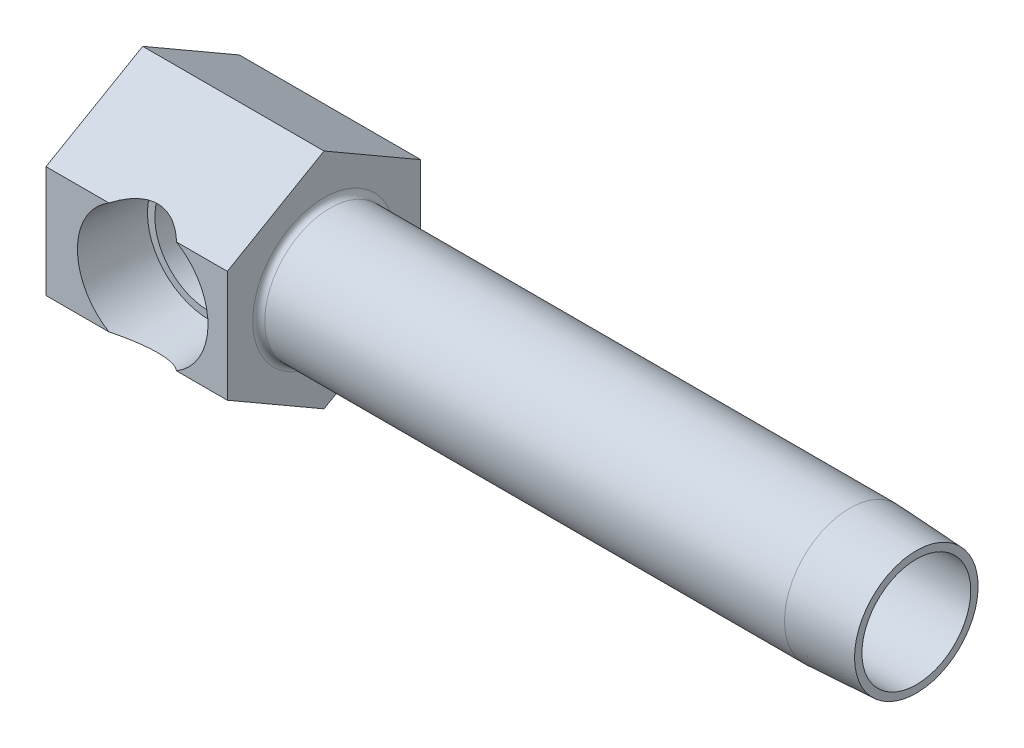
ISO-10303-21;
HEADER;
FILE_DESCRIPTION(('STEP AP214'),'2;1');
FILE_NAME('part.step','',(''),(''),'','','');
FILE_SCHEMA(('AUTOMOTIVE_DESIGN { 1 0 10303 214 1 1 1 1 }'));
ENDSEC;
DATA;
#1=APPLICATION_CONTEXT('core data for automotive mechanical design processes');
#2=APPLICATION_PROTOCOL_DEFINITION('international standard','automotive_design',2000,#1);
#3=PRODUCT_CONTEXT('',#1,'mechanical');
#4=PRODUCT('Part','Part','',(#3));
#5=PRODUCT_RELATED_PRODUCT_CATEGORY('part','',(#4));
#6=PRODUCT_DEFINITION_FORMATION('','',#4);
#7=PRODUCT_DEFINITION_CONTEXT('part definition',#1,'design');
#8=PRODUCT_DEFINITION('design','',#6,#7);
#9=PRODUCT_DEFINITION_SHAPE('','',#8);
#10=(LENGTH_UNIT() NAMED_UNIT(*) SI_UNIT(.MILLI.,.METRE.));
#11=(NAMED_UNIT(*) PLANE_ANGLE_UNIT() SI_UNIT($,.RADIAN.));
#12=(NAMED_UNIT(*) SI_UNIT($,.STERADIAN.) SOLID_ANGLE_UNIT());
#13=UNCERTAINTY_MEASURE_WITH_UNIT(LENGTH_MEASURE(1.E-05),#10,'distance_accuracy_value','');
#14=(GEOMETRIC_REPRESENTATION_CONTEXT(3) GLOBAL_UNCERTAINTY_ASSIGNED_CONTEXT((#13)) GLOBAL_UNIT_ASSIGNED_CONTEXT((#10,
#11,#12)) REPRESENTATION_CONTEXT('',''));
#15=CARTESIAN_POINT('',(0.,0.,0.));
#16=DIRECTION('',(0.,0.,1.));
#17=DIRECTION('',(1.,0.,0.));
#18=AXIS2_PLACEMENT_3D('',#15,#16,#17);
#19=CARTESIAN_POINT('',(63.5,0.,12.7));
#20=DIRECTION('',(-1.,0.,0.));
#21=DIRECTION('',(0.,-1.,0.));
#22=AXIS2_PLACEMENT_3D('',#19,#20,#21);
#23=CYLINDRICAL_SURFACE('',#22,8.5725);
#24=CARTESIAN_POINT('',(24.5999,0.,12.7));
#25=DIRECTION('',(-1.,0.,0.));
#26=DIRECTION('',(0.,-1.,0.));
#27=AXIS2_PLACEMENT_3D('',#24,#25,#26);
#28=CIRCLE('',#27,8.5725);
#29=CARTESIAN_POINT('',(24.5999,-8.57249999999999,12.7));
#30=VERTEX_POINT('',#29);
#31=EDGE_CURVE('E22',#30,#30,#28,.F.);
#32=ORIENTED_EDGE('',*,*,#31,.T.);
#33=EDGE_LOOP('',(#32));
#34=FACE_BOUND('',#33,.T.);
#35=CARTESIAN_POINT('',(92.8624,0.,12.7));
#36=DIRECTION('',(-1.,0.,0.));
#37=DIRECTION('',(0.,0.,1.));
#38=AXIS2_PLACEMENT_3D('',#35,#36,#37);
#39=CIRCLE('',#38,8.5725);
#40=CARTESIAN_POINT('',(92.8624,0.,21.2725));
#41=VERTEX_POINT('',#40);
#42=EDGE_CURVE('E153',#41,#41,#39,.T.);
#43=ORIENTED_EDGE('',*,*,#42,.T.);
#44=EDGE_LOOP('',(#43));
#45=FACE_BOUND('',#44,.T.);
#46=ADVANCED_FACE('F15',(#34,#45),#23,.T.);
#47=CARTESIAN_POINT('',(23.8125,14.6646968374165,12.7));
#48=DIRECTION('',(0.,-0.866025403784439,-0.5));
#49=DIRECTION('',(0.,0.5,-0.866025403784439));
#50=AXIS2_PLACEMENT_3D('',#47,#48,#49);
#51=PLANE('',#50);
#52=CARTESIAN_POINT('',(12.7,-0.84553451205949,39.56450873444));
#53=DIRECTION('',(0.,-0.866025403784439,-0.5));
#54=DIRECTION('',(0.,-0.5,0.866025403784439));
#55=AXIS2_PLACEMENT_3D('',#52,#53,#54);
#56=ELLIPSE('',#55,18.6296608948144,9.27637524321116);
#57=CARTESIAN_POINT('',(17.1412186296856,7.33234841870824,25.4));
#58=VERTEX_POINT('',#57);
#59=CARTESIAN_POINT('',(8.25878137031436,7.33234841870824,25.4));
#60=VERTEX_POINT('',#59);
#61=EDGE_CURVE('E232',#58,#60,#56,.F.);
#62=ORIENTED_EDGE('',*,*,#61,.F.);
#63=DIRECTION('',(-1.,0.,0.));
#64=VECTOR('',#63,1.);
#65=CARTESIAN_POINT('',(23.8125,7.33234841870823,25.4));
#66=LINE('',#65,#64);
#67=CARTESIAN_POINT('',(23.8125,7.33234841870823,25.4));
#68=VERTEX_POINT('',#67);
#69=EDGE_CURVE('E202',#68,#58,#66,.T.);
#70=ORIENTED_EDGE('',*,*,#69,.F.);
#71=DIRECTION('',(0.,-0.5,0.866025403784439));
#72=VECTOR('',#71,1.);
#73=CARTESIAN_POINT('',(23.8125,14.6646968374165,12.7));
#74=LINE('',#73,#72);
#75=CARTESIAN_POINT('',(23.8125,14.6646968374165,12.7));
#76=VERTEX_POINT('',#75);
#77=EDGE_CURVE('E222',#76,#68,#74,.T.);
#78=ORIENTED_EDGE('',*,*,#77,.F.);
#79=DIRECTION('',(-1.,0.,0.));
#80=VECTOR('',#79,1.);
#81=CARTESIAN_POINT('',(23.8125,14.6646968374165,12.7));
#82=LINE('',#81,#80);
#83=CARTESIAN_POINT('',(0.,14.6646968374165,12.7));
#84=VERTEX_POINT('',#83);
#85=EDGE_CURVE('E199',#76,#84,#82,.T.);
#86=ORIENTED_EDGE('',*,*,#85,.T.);
#87=DIRECTION('',(0.,-0.5,0.866025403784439));
#88=VECTOR('',#87,1.);
#89=CARTESIAN_POINT('',(0.,14.6646968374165,12.7));
#90=LINE('',#89,#88);
#91=CARTESIAN_POINT('',(0.,7.33234841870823,25.4));
#92=VERTEX_POINT('',#91);
#93=EDGE_CURVE('E239',#84,#92,#90,.T.);
#94=ORIENTED_EDGE('',*,*,#93,.T.);
#95=EDGE_CURVE('E205',#60,#92,#66,.T.);
#96=ORIENTED_EDGE('',*,*,#95,.F.);
#97=EDGE_LOOP('',(#62,#70,#78,#86,#94,#96));
#98=FACE_BOUND('',#97,.T.);
#99=ADVANCED_FACE('F174',(#98),#51,.F.);
#100=CARTESIAN_POINT('',(23.8125,7.33234841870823,25.4));
#101=DIRECTION('',(0.,0.,-1.));
#102=DIRECTION('',(-1.,0.,0.));
#103=AXIS2_PLACEMENT_3D('',#100,#101,#102);
#104=PLANE('',#103);
#105=CARTESIAN_POINT('',(12.7,0.,25.4));
#106=DIRECTION('',(0.,0.,-1.));
#107=DIRECTION('',(-1.,0.,0.));
#108=AXIS2_PLACEMENT_3D('',#105,#106,#107);
#109=CIRCLE('',#108,8.5725);
#110=CARTESIAN_POINT('',(17.1412186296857,-7.33234841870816,25.4));
#111=VERTEX_POINT('',#110);
#112=EDGE_CURVE('E249',#58,#111,#109,.T.);
#113=ORIENTED_EDGE('',*,*,#112,.T.);
#114=DIRECTION('',(-1.,0.,0.));
#115=VECTOR('',#114,1.);
#116=CARTESIAN_POINT('',(23.8125,-7.33234841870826,25.4));
#117=LINE('',#116,#115);
#118=CARTESIAN_POINT('',(23.8125,-7.33234841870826,25.4));
#119=VERTEX_POINT('',#118);
#120=EDGE_CURVE('E206',#119,#111,#117,.T.);
#121=ORIENTED_EDGE('',*,*,#120,.F.);
#122=DIRECTION('',(0.,-1.,0.));
#123=VECTOR('',#122,1.);
#124=CARTESIAN_POINT('',(23.8125,7.33234841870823,25.4));
#125=LINE('',#124,#123);
#126=EDGE_CURVE('E220',#68,#119,#125,.T.);
#127=ORIENTED_EDGE('',*,*,#126,.F.);
#128=ORIENTED_EDGE('',*,*,#69,.T.);
#129=EDGE_LOOP('',(#113,#121,#127,#128));
#130=FACE_BOUND('',#129,.T.);
#131=ADVANCED_FACE('F180',(#130),#104,.F.);
#132=CARTESIAN_POINT('',(8.25878137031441,-7.33234841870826,25.4));
#133=VERTEX_POINT('',#132);
#134=EDGE_CURVE('E36',#133,#60,#109,.T.);
#135=ORIENTED_EDGE('',*,*,#134,.T.);
#136=ORIENTED_EDGE('',*,*,#95,.T.);
#137=DIRECTION('',(0.,-1.,0.));
#138=VECTOR('',#137,1.);
#139=CARTESIAN_POINT('',(0.,7.33234841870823,25.4));
#140=LINE('',#139,#138);
#141=CARTESIAN_POINT('',(0.,-7.33234841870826,25.4));
#142=VERTEX_POINT('',#141);
#143=EDGE_CURVE('E235',#92,#142,#140,.T.);
#144=ORIENTED_EDGE('',*,*,#143,.T.);
#145=EDGE_CURVE('E209',#133,#142,#117,.T.);
#146=ORIENTED_EDGE('',*,*,#145,.F.);
#147=EDGE_LOOP('',(#135,#136,#144,#146));
#148=FACE_BOUND('',#147,.T.);
#149=ADVANCED_FACE('F285',(#148),#104,.F.);
#150=CARTESIAN_POINT('',(23.8125,-7.33234841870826,25.4));
#151=DIRECTION('',(0.,0.86602540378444,-0.5));
#152=DIRECTION('',(0.,0.5,0.86602540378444));
#153=AXIS2_PLACEMENT_3D('',#150,#151,#152);
#154=PLANE('',#153);
#155=CARTESIAN_POINT('',(12.7,0.845534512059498,39.5645087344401));
#156=DIRECTION('',(0.,0.86602540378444,-0.5));
#157=DIRECTION('',(0.,0.5,0.86602540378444));
#158=AXIS2_PLACEMENT_3D('',#155,#156,#157);
#159=ELLIPSE('',#158,18.6296608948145,9.27637524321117);
#160=EDGE_CURVE('E10',#133,#111,#159,.F.);
#161=ORIENTED_EDGE('',*,*,#160,.F.);
#162=ORIENTED_EDGE('',*,*,#145,.T.);
#163=DIRECTION('',(0.,-0.5,-0.86602540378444));
#164=VECTOR('',#163,1.);
#165=CARTESIAN_POINT('',(0.,-7.33234841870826,25.4));
#166=LINE('',#165,#164);
#167=CARTESIAN_POINT('',(0.,-14.6646968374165,12.7));
#168=VERTEX_POINT('',#167);
#169=EDGE_CURVE('E218',#142,#168,#166,.T.);
#170=ORIENTED_EDGE('',*,*,#169,.T.);
#171=DIRECTION('',(-1.,0.,0.));
#172=VECTOR('',#171,1.);
#173=CARTESIAN_POINT('',(23.8125,-14.6646968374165,12.7));
#174=LINE('',#173,#172);
#175=CARTESIAN_POINT('',(23.8125,-14.6646968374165,12.7));
#176=VERTEX_POINT('',#175);
#177=EDGE_CURVE('E210',#176,#168,#174,.T.);
#178=ORIENTED_EDGE('',*,*,#177,.F.);
#179=DIRECTION('',(0.,-0.5,-0.86602540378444));
#180=VECTOR('',#179,1.);
#181=CARTESIAN_POINT('',(23.8125,-7.33234841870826,25.4));
#182=LINE('',#181,#180);
#183=EDGE_CURVE('E213',#119,#176,#182,.T.);
#184=ORIENTED_EDGE('',*,*,#183,.F.);
#185=ORIENTED_EDGE('',*,*,#120,.T.);
#186=EDGE_LOOP('',(#161,#162,#170,#178,#184,#185));
#187=FACE_BOUND('',#186,.T.);
#188=ADVANCED_FACE('F281',(#187),#154,.F.);
#189=CARTESIAN_POINT('',(23.8125,-14.6646968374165,12.7));
#190=DIRECTION('',(0.,0.866025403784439,0.5));
#191=DIRECTION('',(0.,-0.5,0.866025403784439));
#192=AXIS2_PLACEMENT_3D('',#189,#190,#191);
#193=PLANE('',#192);
#194=DIRECTION('',(0.,0.5,-0.866025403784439));
#195=VECTOR('',#194,1.);
#196=CARTESIAN_POINT('',(0.,-14.6646968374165,12.7));
#197=LINE('',#196,#195);
#198=CARTESIAN_POINT('',(0.,-7.33234841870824,0.));
#199=VERTEX_POINT('',#198);
#200=EDGE_CURVE('E227',#168,#199,#197,.T.);
#201=ORIENTED_EDGE('',*,*,#200,.T.);
#202=DIRECTION('',(-1.,0.,0.));
#203=VECTOR('',#202,1.);
#204=CARTESIAN_POINT('',(23.8125,-7.33234841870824,0.));
#205=LINE('',#204,#203);
#206=CARTESIAN_POINT('',(23.8125,-7.33234841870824,0.));
#207=VERTEX_POINT('',#206);
#208=EDGE_CURVE('E191',#207,#199,#205,.T.);
#209=ORIENTED_EDGE('',*,*,#208,.F.);
#210=DIRECTION('',(0.,0.5,-0.866025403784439));
#211=VECTOR('',#210,1.);
#212=CARTESIAN_POINT('',(23.8125,-14.6646968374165,12.7));
#213=LINE('',#212,#211);
#214=EDGE_CURVE('E214',#176,#207,#213,.T.);
#215=ORIENTED_EDGE('',*,*,#214,.F.);
#216=ORIENTED_EDGE('',*,*,#177,.T.);
#217=EDGE_LOOP('',(#201,#209,#215,#216));
#218=FACE_BOUND('',#217,.T.);
#219=ADVANCED_FACE('F284',(#218),#193,.F.);
#220=CARTESIAN_POINT('',(23.8125,-7.33234841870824,0.));
#221=DIRECTION('',(0.,0.,1.));
#222=DIRECTION('',(0.,-1.,0.));
#223=AXIS2_PLACEMENT_3D('',#220,#221,#222);
#224=PLANE('',#223);
#225=DIRECTION('',(0.,1.,0.));
#226=VECTOR('',#225,1.);
#227=CARTESIAN_POINT('',(0.,-7.33234841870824,0.));
#228=LINE('',#227,#226);
#229=CARTESIAN_POINT('',(0.,7.33234841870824,0.));
#230=VERTEX_POINT('',#229);
#231=EDGE_CURVE('E231',#199,#230,#228,.T.);
#232=ORIENTED_EDGE('',*,*,#231,.T.);
#233=DIRECTION('',(-1.,0.,0.));
#234=VECTOR('',#233,1.);
#235=CARTESIAN_POINT('',(23.8125,7.33234841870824,0.));
#236=LINE('',#235,#234);
#237=CARTESIAN_POINT('',(23.8125,7.33234841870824,0.));
#238=VERTEX_POINT('',#237);
#239=EDGE_CURVE('E196',#238,#230,#236,.T.);
#240=ORIENTED_EDGE('',*,*,#239,.F.);
#241=DIRECTION('',(0.,1.,0.));
#242=VECTOR('',#241,1.);
#243=CARTESIAN_POINT('',(23.8125,-7.33234841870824,0.));
#244=LINE('',#243,#242);
#245=EDGE_CURVE('E217',#207,#238,#244,.T.);
#246=ORIENTED_EDGE('',*,*,#245,.F.);
#247=ORIENTED_EDGE('',*,*,#208,.T.);
#248=EDGE_LOOP('',(#232,#240,#246,#247));
#249=FACE_BOUND('',#248,.T.);
#250=ADVANCED_FACE('F292',(#249),#224,.F.);
#251=CARTESIAN_POINT('',(23.8125,7.33234841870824,0.));
#252=DIRECTION('',(0.,-0.866025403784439,0.5));
#253=DIRECTION('',(0.,-0.5,-0.866025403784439));
#254=AXIS2_PLACEMENT_3D('',#251,#252,#253);
#255=PLANE('',#254);
#256=DIRECTION('',(0.,0.5,0.866025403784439));
#257=VECTOR('',#256,1.);
#258=CARTESIAN_POINT('',(0.,7.33234841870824,0.));
#259=LINE('',#258,#257);
#260=EDGE_CURVE('E243',#230,#84,#259,.T.);
#261=ORIENTED_EDGE('',*,*,#260,.T.);
#262=ORIENTED_EDGE('',*,*,#85,.F.);
#263=DIRECTION('',(0.,0.5,0.866025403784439));
#264=VECTOR('',#263,1.);
#265=CARTESIAN_POINT('',(23.8125,7.33234841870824,0.));
#266=LINE('',#265,#264);
#267=EDGE_CURVE('E224',#238,#76,#266,.T.);
#268=ORIENTED_EDGE('',*,*,#267,.F.);
#269=ORIENTED_EDGE('',*,*,#239,.T.);
#270=EDGE_LOOP('',(#261,#262,#268,#269));
#271=FACE_BOUND('',#270,.T.);
#272=ADVANCED_FACE('F279',(#271),#255,.F.);
#273=CARTESIAN_POINT('',(23.8125,-21.9970452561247,25.4));
#274=DIRECTION('',(-1.,0.,0.));
#275=DIRECTION('',(0.,-1.,0.));
#276=AXIS2_PLACEMENT_3D('',#273,#274,#275);
#277=PLANE('',#276);
#278=CARTESIAN_POINT('',(23.8125,0.,12.7));
#279=DIRECTION('',(-1.,0.,0.));
#280=DIRECTION('',(0.,-1.,0.));
#281=AXIS2_PLACEMENT_3D('',#278,#279,#280);
#282=CIRCLE('',#281,9.3599);
#283=CARTESIAN_POINT('',(23.8125,-9.35989999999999,12.7));
#284=VERTEX_POINT('',#283);
#285=EDGE_CURVE('E189',#284,#284,#282,.T.);
#286=ORIENTED_EDGE('',*,*,#285,.T.);
#287=EDGE_LOOP('',(#286));
#288=FACE_BOUND('',#287,.T.);
#289=ORIENTED_EDGE('',*,*,#214,.T.);
#290=ORIENTED_EDGE('',*,*,#245,.T.);
#291=ORIENTED_EDGE('',*,*,#267,.T.);
#292=ORIENTED_EDGE('',*,*,#77,.T.);
#293=ORIENTED_EDGE('',*,*,#126,.T.);
#294=ORIENTED_EDGE('',*,*,#183,.T.);
#295=EDGE_LOOP('',(#289,#290,#291,#292,#293,#294));
#296=FACE_BOUND('',#295,.T.);
#297=ADVANCED_FACE('F275',(#288,#296),#277,.F.);
#298=CARTESIAN_POINT('',(0.,-21.9970452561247,25.4));
#299=DIRECTION('',(-1.,0.,0.));
#300=DIRECTION('',(0.,-1.,0.));
#301=AXIS2_PLACEMENT_3D('',#298,#299,#300);
#302=PLANE('',#301);
#303=ORIENTED_EDGE('',*,*,#200,.F.);
#304=ORIENTED_EDGE('',*,*,#169,.F.);
#305=ORIENTED_EDGE('',*,*,#143,.F.);
#306=ORIENTED_EDGE('',*,*,#93,.F.);
#307=ORIENTED_EDGE('',*,*,#260,.F.);
#308=ORIENTED_EDGE('',*,*,#231,.F.);
#309=EDGE_LOOP('',(#303,#304,#305,#306,#307,#308));
#310=FACE_BOUND('',#309,.T.);
#311=ADVANCED_FACE('F272',(#310),#302,.T.);
#312=CARTESIAN_POINT('',(24.5999,0.,12.7));
#313=DIRECTION('',(-1.,0.,0.));
#314=DIRECTION('',(0.,-1.,0.));
#315=AXIS2_PLACEMENT_3D('',#312,#313,#314);
#316=TOROIDAL_SURFACE('',#315,9.3599,0.7874);
#317=ORIENTED_EDGE('',*,*,#31,.F.);
#318=EDGE_LOOP('',(#317));
#319=FACE_BOUND('',#318,.T.);
#320=ORIENTED_EDGE('',*,*,#285,.F.);
#321=EDGE_LOOP('',(#320));
#322=FACE_BOUND('',#321,.T.);
#323=ADVANCED_FACE('F269',(#319,#322),#316,.F.);
#324=CARTESIAN_POINT('',(12.7,0.,25.4));
#325=DIRECTION('',(0.,0.,1.));
#326=DIRECTION('',(1.,0.,0.));
#327=AXIS2_PLACEMENT_3D('',#324,#325,#326);
#328=CONICAL_SURFACE('',#327,8.5725,0.0523598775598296);
#329=CARTESIAN_POINT('',(18.2237788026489,-5.94425228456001,16.6622));
#330=CARTESIAN_POINT('',(18.2916176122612,-5.88732299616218,16.7476009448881));
#331=CARTESIAN_POINT('',(18.3592795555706,-5.82850059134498,16.8318676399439));
#332=CARTESIAN_POINT('',(18.4939968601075,-5.70702027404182,16.9981035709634));
#333=CARTESIAN_POINT('',(18.5610521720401,-5.64436205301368,17.0800726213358));
#334=CARTESIAN_POINT('',(18.761107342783,-5.45038497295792,17.3227058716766));
#335=CARTESIAN_POINT('',(18.8927964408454,-5.31322998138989,17.479846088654));
#336=CARTESIAN_POINT('',(19.1518580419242,-5.0216447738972,17.785397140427));
#337=CARTESIAN_POINT('',(19.2791735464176,-4.8670541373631,17.933703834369));
#338=CARTESIAN_POINT('',(19.5257752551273,-4.5416930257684,18.2184184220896));
#339=CARTESIAN_POINT('',(19.6450670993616,-4.37093412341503,18.35483469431));
#340=CARTESIAN_POINT('',(19.9295445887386,-3.92497659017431,18.6779693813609));
#341=CARTESIAN_POINT('',(20.0885588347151,-3.63961711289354,18.8565618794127));
#342=CARTESIAN_POINT('',(20.3031266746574,-3.18637161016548,19.0960411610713));
#343=CARTESIAN_POINT('',(20.3705741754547,-3.03133869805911,19.1710418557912));
#344=CARTESIAN_POINT('',(20.4965477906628,-2.71316594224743,19.3107517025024));
#345=CARTESIAN_POINT('',(20.5550753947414,-2.55002745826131,19.3754625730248));
#346=CARTESIAN_POINT('',(20.6538405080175,-2.24208944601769,19.4844409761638));
#347=CARTESIAN_POINT('',(20.6955064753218,-2.09831594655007,19.5303217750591));
#348=CARTESIAN_POINT('',(20.7709604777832,-1.80624508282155,19.6132970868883));
#349=CARTESIAN_POINT('',(20.8047499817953,-1.65794856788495,19.6503932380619));
#350=CARTESIAN_POINT('',(20.8638747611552,-1.35762804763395,19.7152415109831));
#351=CARTESIAN_POINT('',(20.8892082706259,-1.20560327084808,19.7429916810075));
#352=CARTESIAN_POINT('',(20.9309344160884,-0.898862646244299,19.7886706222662));
#353=CARTESIAN_POINT('',(20.9473269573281,-0.744146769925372,19.8065992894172));
#354=CARTESIAN_POINT('',(20.9708773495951,-0.43270553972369,19.8323499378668));
#355=CARTESIAN_POINT('',(20.9780075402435,-0.275975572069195,19.8401416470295));
#356=CARTESIAN_POINT('',(20.9827943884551,0.0378027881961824,19.8453730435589));
#357=CARTESIAN_POINT('',(20.9804510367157,0.194851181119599,19.8428127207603));
#358=CARTESIAN_POINT('',(20.9663398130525,0.508011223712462,19.8273884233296));
#359=CARTESIAN_POINT('',(20.9545719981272,0.664122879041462,19.8145245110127));
#360=CARTESIAN_POINT('',(20.9218545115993,0.974205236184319,19.77873224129));
#361=CARTESIAN_POINT('',(20.9009049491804,1.12817596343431,19.755804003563));
#362=CARTESIAN_POINT('',(20.8514678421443,1.42545941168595,19.701637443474));
#363=CARTESIAN_POINT('',(20.8233975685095,1.56892578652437,19.670858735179));
#364=CARTESIAN_POINT('',(20.7597875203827,1.85215468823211,19.6010144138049));
#365=CARTESIAN_POINT('',(20.7242449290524,1.99191579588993,19.5619456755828));
#366=CARTESIAN_POINT('',(20.6072066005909,2.40450989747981,19.4330773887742));
#367=CARTESIAN_POINT('',(20.5152596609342,2.67089071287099,19.3315714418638));
#368=CARTESIAN_POINT('',(20.3408066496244,3.10208873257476,19.1379689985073));
#369=CARTESIAN_POINT('',(20.2643220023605,3.27264094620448,19.0528363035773));
#370=CARTESIAN_POINT('',(20.1020422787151,3.60309741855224,18.8714152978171));
#371=CARTESIAN_POINT('',(20.0162439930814,3.76299797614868,18.7751231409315));
#372=CARTESIAN_POINT('',(19.7465644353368,4.22699236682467,18.4708514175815));
#373=CARTESIAN_POINT('',(19.550728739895,4.51459085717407,18.2478400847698));
#374=CARTESIAN_POINT('',(19.2565333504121,4.89305951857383,17.9071622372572));
#375=CARTESIAN_POINT('',(19.1663785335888,5.00247887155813,17.8020703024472));
#376=CARTESIAN_POINT('',(18.9830153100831,5.21324568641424,17.5865045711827));
#377=CARTESIAN_POINT('',(18.8898069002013,5.31459313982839,17.4760307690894));
#378=CARTESIAN_POINT('',(18.7018932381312,5.50848003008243,17.2510129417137));
#379=CARTESIAN_POINT('',(18.6072061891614,5.60108407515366,17.1365090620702));
#380=CARTESIAN_POINT('',(18.4163909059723,5.77848578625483,16.9028222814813));
#381=CARTESIAN_POINT('',(18.320263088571,5.86328566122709,16.783640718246));
#382=CARTESIAN_POINT('',(18.2237788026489,5.94425228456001,16.6622));
#383=B_SPLINE_CURVE_WITH_KNOTS('',3,(#329,#330,#331,#332,#333,#334,#335,#336,#337,#338,#339,
#340,#341,#342,#343,#344,#345,#346,#347,#348,#349,#350,#351,#352,#353,#354,#355,#356,#357,#358,
#359,#360,#361,#362,#363,#364,#365,#366,#367,#368,#369,#370,#371,#372,#373,#374,#375,#376,#377,
#378,#379,#380,#381,#382),.UNSPECIFIED.,.F.,.F.,(4,2,2,2,2,2,2,2,2,2,2,2,2,2,2,2,2,2,2,2,2,2,2,
2,2,2,4),(0.,0.369050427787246,0.738130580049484,1.47737063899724,2.22407355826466,
2.97024599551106,4.0822255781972,4.63656388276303,5.19080950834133,5.66002823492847,
6.12915938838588,6.59838844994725,7.0676224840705,7.53825460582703,8.00888718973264,
8.47951692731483,8.95014106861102,9.3978219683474,9.8456719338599,10.7406458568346,
11.3560801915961,11.9717272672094,13.2057730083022,13.7350494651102,14.2643264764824,
14.7893227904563,15.3141700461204),.UNSPECIFIED.);
#384=CARTESIAN_POINT('',(18.2239376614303,-5.94411896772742,16.6624));
#385=VERTEX_POINT('',#384);
#386=CARTESIAN_POINT('',(18.2239376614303,5.94411896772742,16.6624));
#387=VERTEX_POINT('',#386);
#388=EDGE_CURVE('E128',#385,#387,#383,.T.);
#389=ORIENTED_EDGE('',*,*,#388,.F.);
#390=CARTESIAN_POINT('',(12.7,0.,16.6624));
#391=DIRECTION('',(0.,0.,-1.));
#392=DIRECTION('',(-1.,0.,0.));
#393=AXIS2_PLACEMENT_3D('',#390,#391,#392);
#394=CIRCLE('',#393,8.1145817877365);
#395=EDGE_CURVE('E251',#385,#387,#394,.T.);
#396=ORIENTED_EDGE('',*,*,#395,.T.);
#397=EDGE_LOOP('',(#389,#396));
#398=FACE_BOUND('',#397,.T.);
#399=ORIENTED_EDGE('',*,*,#61,.T.);
#400=ORIENTED_EDGE('',*,*,#134,.F.);
#401=ORIENTED_EDGE('',*,*,#160,.T.);
#402=ORIENTED_EDGE('',*,*,#112,.F.);
#403=EDGE_LOOP('',(#399,#400,#401,#402));
#404=FACE_BOUND('',#403,.T.);
#405=ADVANCED_FACE('F136',(#398,#404),#328,.F.);
#406=CARTESIAN_POINT('',(20.8145817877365,0.,16.6624));
#407=DIRECTION('',(0.,0.,1.));
#408=DIRECTION('',(1.,0.,0.));
#409=AXIS2_PLACEMENT_3D('',#406,#407,#408);
#410=PLANE('',#409);
#411=DIRECTION('',(1.,0.,0.));
#412=VECTOR('',#411,1.);
#413=CARTESIAN_POINT('',(66.667520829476,-5.94411896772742,16.6624));
#414=LINE('',#413,#412);
#415=CARTESIAN_POINT('',(16.6624,-5.9441189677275,16.6624));
#416=VERTEX_POINT('',#415);
#417=EDGE_CURVE('E123',#416,#385,#414,.T.);
#418=ORIENTED_EDGE('',*,*,#417,.F.);
#419=CARTESIAN_POINT('',(12.7,0.,16.6624));
#420=DIRECTION('',(0.,0.,-1.));
#421=DIRECTION('',(-1.,0.,0.));
#422=AXIS2_PLACEMENT_3D('',#419,#420,#421);
#423=CIRCLE('',#422,7.14375);
#424=CARTESIAN_POINT('',(16.6624,5.9441189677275,16.6624));
#425=VERTEX_POINT('',#424);
#426=EDGE_CURVE('E119',#416,#425,#423,.T.);
#427=ORIENTED_EDGE('',*,*,#426,.T.);
#428=DIRECTION('',(1.,0.,0.));
#429=VECTOR('',#428,1.);
#430=CARTESIAN_POINT('',(66.667520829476,5.94411896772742,16.6624));
#431=LINE('',#430,#429);
#432=EDGE_CURVE('E120',#387,#425,#431,.F.);
#433=ORIENTED_EDGE('',*,*,#432,.F.);
#434=ORIENTED_EDGE('',*,*,#395,.F.);
#435=EDGE_LOOP('',(#418,#427,#433,#434));
#436=FACE_BOUND('',#435,.T.);
#437=ADVANCED_FACE('F262',(#436),#410,.T.);
#438=CARTESIAN_POINT('',(12.7,0.,34.595573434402));
#439=DIRECTION('',(0.,0.,-1.));
#440=DIRECTION('',(-1.,0.,0.));
#441=AXIS2_PLACEMENT_3D('',#438,#439,#440);
#442=CYLINDRICAL_SURFACE('',#441,7.14375);
#443=CARTESIAN_POINT('',(12.7,0.,12.7));
#444=DIRECTION('',(0.707106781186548,0.,-0.707106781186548));
#445=DIRECTION('',(-0.707106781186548,0.,-0.707106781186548));
#446=AXIS2_PLACEMENT_3D('',#443,#444,#445);
#447=ELLIPSE('',#446,10.1027881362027,7.14375);
#448=CARTESIAN_POINT('',(12.7,7.14375,12.7));
#449=VERTEX_POINT('',#448);
#450=EDGE_CURVE('E121',#425,#449,#447,.F.);
#451=ORIENTED_EDGE('',*,*,#450,.F.);
#452=ORIENTED_EDGE('',*,*,#426,.F.);
#453=CARTESIAN_POINT('',(12.7,-7.14375,12.7));
#454=VERTEX_POINT('',#453);
#455=EDGE_CURVE('E108',#454,#416,#447,.F.);
#456=ORIENTED_EDGE('',*,*,#455,.F.);
#457=CARTESIAN_POINT('',(12.7,0.,12.7));
#458=DIRECTION('',(-0.707106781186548,0.,-0.707106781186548));
#459=DIRECTION('',(0.707106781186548,0.,-0.707106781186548));
#460=AXIS2_PLACEMENT_3D('',#457,#458,#459);
#461=ELLIPSE('',#460,10.1027881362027,7.14375);
#462=CARTESIAN_POINT('',(18.1005540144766,-4.67623570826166,7.2994459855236));
#463=VERTEX_POINT('',#462);
#464=EDGE_CURVE('E104',#463,#454,#461,.T.);
#465=ORIENTED_EDGE('',*,*,#464,.F.);
#466=CARTESIAN_POINT('',(12.7,0.,7.2994459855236));
#467=DIRECTION('',(0.,0.,-1.));
#468=DIRECTION('',(-1.,0.,0.));
#469=AXIS2_PLACEMENT_3D('',#466,#467,#468);
#470=CIRCLE('',#469,7.14375);
#471=CARTESIAN_POINT('',(18.1005540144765,4.67623570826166,7.2994459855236));
#472=VERTEX_POINT('',#471);
#473=EDGE_CURVE('E134',#463,#472,#470,.T.);
#474=ORIENTED_EDGE('',*,*,#473,.T.);
#475=EDGE_CURVE('E29',#449,#472,#461,.T.);
#476=ORIENTED_EDGE('',*,*,#475,.F.);
#477=EDGE_LOOP('',(#451,#452,#456,#465,#474,#476));
#478=FACE_BOUND('',#477,.T.);
#479=ADVANCED_FACE('F117',(#478),#442,.F.);
#480=CARTESIAN_POINT('',(12.7,0.,7.2994459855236));
#481=DIRECTION('',(0.,0.,1.));
#482=DIRECTION('',(1.,0.,0.));
#483=AXIS2_PLACEMENT_3D('',#480,#481,#482);
#484=CONICAL_SURFACE('',#483,7.14375,1.0471975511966);
#485=CARTESIAN_POINT('',(18.1008122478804,4.67646667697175,7.29964598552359));
#486=CARTESIAN_POINT('',(18.0182484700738,4.60263120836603,7.23572166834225));
#487=CARTESIAN_POINT('',(17.9383238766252,4.52571856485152,7.17175555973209));
#488=CARTESIAN_POINT('',(17.7848563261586,4.36518020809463,7.0441228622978));
#489=CARTESIAN_POINT('',(17.7113260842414,4.28154172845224,6.98045709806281));
#490=CARTESIAN_POINT('',(17.5726476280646,4.1079855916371,6.8545747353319));
#491=CARTESIAN_POINT('',(17.5074361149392,4.01812452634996,6.79235056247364));
#492=CARTESIAN_POINT('',(17.3859720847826,3.83151153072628,6.66964834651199));
#493=CARTESIAN_POINT('',(17.3297132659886,3.73476451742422,6.60916909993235));
#494=CARTESIAN_POINT('',(17.2264163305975,3.53345239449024,6.49019348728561));
#495=CARTESIAN_POINT('',(17.1794940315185,3.42880893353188,6.43172867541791));
#496=CARTESIAN_POINT('',(17.0960237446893,3.21346156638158,6.31865082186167));
#497=CARTESIAN_POINT('',(17.0594774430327,3.10275667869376,6.26403840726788));
#498=CARTESIAN_POINT('',(16.996254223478,2.87633249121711,6.15970832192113));
#499=CARTESIAN_POINT('',(16.9695794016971,2.76061213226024,6.10999169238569));
#500=CARTESIAN_POINT('',(16.9248366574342,2.52527852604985,6.01627423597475));
#501=CARTESIAN_POINT('',(16.9067703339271,2.40566455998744,5.97227447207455));
#502=CARTESIAN_POINT('',(16.872150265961,2.11917129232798,5.87557836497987));
#503=CARTESIAN_POINT('',(16.8585719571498,1.95102064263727,5.82559588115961));
#504=CARTESIAN_POINT('',(16.8395248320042,1.61106163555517,5.73806695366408));
#505=CARTESIAN_POINT('',(16.834060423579,1.43925134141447,5.70052727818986));
#506=CARTESIAN_POINT('',(16.8272216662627,1.09272483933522,5.63811598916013));
#507=CARTESIAN_POINT('',(16.8258602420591,0.918001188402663,5.61328461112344));
#508=CARTESIAN_POINT('',(16.8244844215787,0.567245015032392,5.576623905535));
#509=CARTESIAN_POINT('',(16.8244696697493,0.391212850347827,5.56479114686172));
#510=CARTESIAN_POINT('',(16.8244315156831,0.0298631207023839,5.55391234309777));
#511=CARTESIAN_POINT('',(16.8244077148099,-0.155475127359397,5.55554105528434));
#512=CARTESIAN_POINT('',(16.8245481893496,-0.525517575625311,5.57319743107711));
#513=CARTESIAN_POINT('',(16.8247125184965,-0.710221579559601,5.58922920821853));
#514=CARTESIAN_POINT('',(16.8272365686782,-1.07761401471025,5.63557061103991));
#515=CARTESIAN_POINT('',(16.8295939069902,-1.26030441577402,5.66586472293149));
#516=CARTESIAN_POINT('',(16.8402108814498,-1.62260116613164,5.74051131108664));
#517=CARTESIAN_POINT('',(16.8484676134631,-1.80220898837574,5.78485686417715));
#518=CARTESIAN_POINT('',(16.8713785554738,-2.09762253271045,5.87004472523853));
#519=CARTESIAN_POINT('',(16.8829850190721,-2.21474934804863,5.90713222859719));
#520=CARTESIAN_POINT('',(16.9127302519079,-2.44618190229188,5.98700326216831));
#521=CARTESIAN_POINT('',(16.9308663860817,-2.56048875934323,6.02978449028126));
#522=CARTESIAN_POINT('',(16.9750927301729,-2.78506409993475,6.12039584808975));
#523=CARTESIAN_POINT('',(17.0011553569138,-2.89534512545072,6.16820809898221));
#524=CARTESIAN_POINT('',(17.0623258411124,-3.11130073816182,6.26827147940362));
#525=CARTESIAN_POINT('',(17.0974329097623,-3.21697572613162,6.3205222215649));
#526=CARTESIAN_POINT('',(17.1773511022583,-3.42340093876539,6.42886299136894));
#527=CARTESIAN_POINT('',(17.2222166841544,-3.52411947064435,6.48497330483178));
#528=CARTESIAN_POINT('',(17.3212699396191,-3.71931545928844,6.59977977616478));
#529=CARTESIAN_POINT('',(17.3754591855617,-3.81379185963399,6.65847636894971));
#530=CARTESIAN_POINT('',(17.4924791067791,-3.99641031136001,6.77768652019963));
#531=CARTESIAN_POINT('',(17.5553313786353,-4.08453566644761,6.83820431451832));
#532=CARTESIAN_POINT('',(17.6884734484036,-4.25426378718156,6.96019752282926));
#533=CARTESIAN_POINT('',(17.758764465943,-4.3358654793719,7.02167309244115));
#534=CARTESIAN_POINT('',(17.8750599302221,-4.46018946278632,7.11938400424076));
#535=CARTESIAN_POINT('',(17.9190095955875,-4.5049692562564,7.15548532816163));
#536=CARTESIAN_POINT('',(18.0086324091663,-4.59230195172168,7.22760435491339));
#537=CARTESIAN_POINT('',(18.0542970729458,-4.6348638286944,7.26362172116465));
#538=CARTESIAN_POINT('',(18.1008122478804,-4.67646667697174,7.29964598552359));
#539=B_SPLINE_CURVE_WITH_KNOTS('',3,(#485,#486,#487,#488,#489,#490,#491,#492,#493,#494,#495,
#496,#497,#498,#499,#500,#501,#502,#503,#504,#505,#506,#507,#508,#509,#510,#511,#512,#513,#514,
#515,#516,#517,#518,#519,#520,#521,#522,#523,#524,#525,#526,#527,#528,#529,#530,#531,#532,#533,
#534,#535,#536,#537,#538),.UNSPECIFIED.,.F.,.F.,(4,2,2,2,2,2,2,2,2,2,2,2,2,2,2,2,2,2,2,2,2,2,2,
2,2,2,4),(0.,0.383734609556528,0.768215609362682,1.14957007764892,1.530654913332,
1.91620690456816,2.30182151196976,2.68751795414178,3.07328600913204,3.60029069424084,
4.12758157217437,4.65653172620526,5.18534222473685,5.74081422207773,6.29644491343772,
6.8514726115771,7.40622727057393,7.77616444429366,8.14595249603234,8.5144681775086,
8.8829517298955,9.25354694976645,9.62420472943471,9.99580384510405,10.3674639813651,
10.5845818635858,10.8007392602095),.UNSPECIFIED.);
#540=EDGE_CURVE('E110',#472,#463,#539,.T.);
#541=ORIENTED_EDGE('',*,*,#540,.F.);
#542=ORIENTED_EDGE('',*,*,#473,.F.);
#543=EDGE_LOOP('',(#541,#542));
#544=FACE_BOUND('',#543,.T.);
#545=CARTESIAN_POINT('',(12.7,0.,3.1750000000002));
#546=VERTEX_POINT('',#545);
#547=VERTEX_LOOP('',#546);
#548=FACE_BOUND('',#547,.T.);
#549=ADVANCED_FACE('F144',(#544,#548),#484,.F.);
#550=CARTESIAN_POINT('',(66.667520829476,0.,12.7));
#551=DIRECTION('',(1.,0.,0.));
#552=DIRECTION('',(0.,0.,-1.));
#553=AXIS2_PLACEMENT_3D('',#550,#551,#552);
#554=CYLINDRICAL_SURFACE('',#553,7.1437499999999);
#555=ORIENTED_EDGE('',*,*,#388,.T.);
#556=ORIENTED_EDGE('',*,*,#432,.T.);
#557=ORIENTED_EDGE('',*,*,#450,.T.);
#558=ORIENTED_EDGE('',*,*,#475,.T.);
#559=ORIENTED_EDGE('',*,*,#540,.T.);
#560=ORIENTED_EDGE('',*,*,#464,.T.);
#561=ORIENTED_EDGE('',*,*,#455,.T.);
#562=ORIENTED_EDGE('',*,*,#417,.T.);
#563=EDGE_LOOP('',(#555,#556,#557,#558,#559,#560,#561,#562));
#564=FACE_BOUND('',#563,.T.);
#565=CARTESIAN_POINT('',(101.6,0.,12.7));
#566=DIRECTION('',(-1.,0.,0.));
#567=DIRECTION('',(0.,0.,1.));
#568=AXIS2_PLACEMENT_3D('',#565,#566,#567);
#569=CIRCLE('',#568,7.1437499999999);
#570=CARTESIAN_POINT('',(101.6,0.,19.8437499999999));
#571=VERTEX_POINT('',#570);
#572=EDGE_CURVE('E159',#571,#571,#569,.T.);
#573=ORIENTED_EDGE('',*,*,#572,.F.);
#574=EDGE_LOOP('',(#573));
#575=FACE_BOUND('',#574,.T.);
#576=ADVANCED_FACE('F106',(#564,#575),#554,.F.);
#577=CARTESIAN_POINT('',(101.6,0.,12.7));
#578=DIRECTION('',(-1.,0.,0.));
#579=DIRECTION('',(0.,0.,1.));
#580=AXIS2_PLACEMENT_3D('',#577,#578,#579);
#581=CONICAL_SURFACE('',#580,8.11458178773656,0.0523598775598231);
#582=ORIENTED_EDGE('',*,*,#42,.F.);
#583=EDGE_LOOP('',(#582));
#584=FACE_BOUND('',#583,.T.);
#585=CARTESIAN_POINT('',(101.6,0.,12.7));
#586=DIRECTION('',(-1.,0.,0.));
#587=DIRECTION('',(0.,0.,1.));
#588=AXIS2_PLACEMENT_3D('',#585,#586,#587);
#589=CIRCLE('',#588,8.11458178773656);
#590=CARTESIAN_POINT('',(101.6,0.,20.8145817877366));
#591=VERTEX_POINT('',#590);
#592=EDGE_CURVE('E156',#591,#591,#589,.T.);
#593=ORIENTED_EDGE('',*,*,#592,.T.);
#594=EDGE_LOOP('',(#593));
#595=FACE_BOUND('',#594,.T.);
#596=ADVANCED_FACE('F143',(#584,#595),#581,.T.);
#597=CARTESIAN_POINT('',(101.6,0.,5.5562500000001));
#598=DIRECTION('',(-1.,0.,0.));
#599=DIRECTION('',(0.,0.,1.));
#600=AXIS2_PLACEMENT_3D('',#597,#598,#599);
#601=PLANE('',#600);
#602=ORIENTED_EDGE('',*,*,#592,.F.);
#603=EDGE_LOOP('',(#602));
#604=FACE_BOUND('',#603,.T.);
#605=ORIENTED_EDGE('',*,*,#572,.T.);
#606=EDGE_LOOP('',(#605));
#607=FACE_BOUND('',#606,.T.);
#608=ADVANCED_FACE('F163',(#604,#607),#601,.F.);
#609=CLOSED_SHELL('',(#46,#99,#131,#149,#188,#219,#250,#272,#297,#311,#323,#405,#437,#479,#549,
#576,#596,#608));
#610=MANIFOLD_SOLID_BREP('B1',#609);
#611=ADVANCED_BREP_SHAPE_REPRESENTATION('',(#18,#610),#14);
#612=SHAPE_DEFINITION_REPRESENTATION(#9,#611);
ENDSEC;
END-ISO-10303-21;
